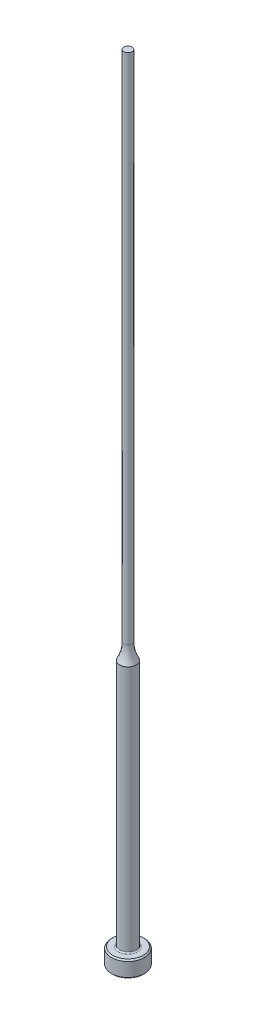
from build123d import *

# Parameters (mm, degrees)
CHAMFER1_SIZE = 0.254
FILLET1_R     = 0.254


with BuildPart() as part:
    # Sketch1 → Revolve1 (revolve)
    with BuildSketch(Plane.XY, mode=Mode.PRIVATE) as revolve1_sk:
        with BuildLine():
            Line((0, 0), (-3.175, 0))
            Line((-3.175, 0), (-3.175, 3.175))
            Line((-3.175, 3.175), (-1.5875, 3.175))
            Line((-1.5875, 3.175), (-1.5875, 50.8))
            ThreePointArc((-1.5875, 50.8), (-0.995388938, 52.286680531), (-0.79375, 53.874180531))
            Line((-0.79375, 53.874180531), (-0.79375, 152.4))
            Line((-0.79375, 152.4), (0, 152.4))
            Line((0, 152.4), (0, 0))
        make_face()
    revolve(revolve1_sk.sketch.rotate(Axis((0, 259.958771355, 0), (0, -1, 0)), 270), axis=Axis((0, 259.958771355, 0), (0, -1, 0)))

    # Chamfer1
    chamfer1_edges = [part.edges().sort_by_distance(p)[0] for p in [
        (0, 0, -3.175),
        (0, 3.175, -3.175),
    ]]
    chamfer(chamfer1_edges, length=CHAMFER1_SIZE)

    # Fillet1
    fillet1_edges = [part.edges().sort_by_distance(p)[0] for p in [
        (0, 3.175, -1.5875),
    ]]
    fillet(fillet1_edges, radius=FILLET1_R)


solid = part.part
